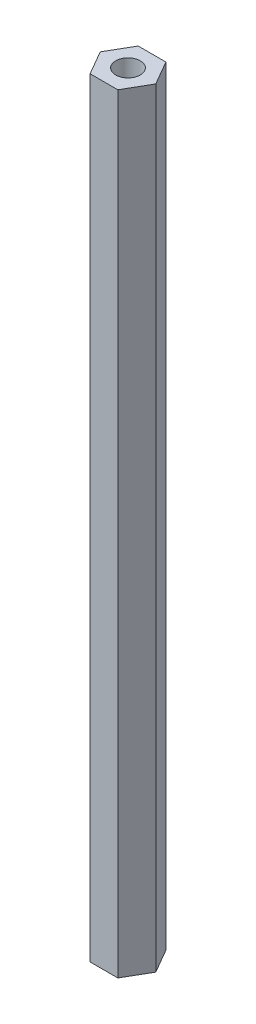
ISO-10303-21;
HEADER;
FILE_DESCRIPTION(('STEP AP214'),'2;1');
FILE_NAME('part.step','',(''),(''),'','','');
FILE_SCHEMA(('AUTOMOTIVE_DESIGN { 1 0 10303 214 1 1 1 1 }'));
ENDSEC;
DATA;
#1=APPLICATION_CONTEXT('core data for automotive mechanical design processes');
#2=APPLICATION_PROTOCOL_DEFINITION('international standard','automotive_design',2000,#1);
#3=PRODUCT_CONTEXT('',#1,'mechanical');
#4=PRODUCT('Part','Part','',(#3));
#5=PRODUCT_RELATED_PRODUCT_CATEGORY('part','',(#4));
#6=PRODUCT_DEFINITION_FORMATION('','',#4);
#7=PRODUCT_DEFINITION_CONTEXT('part definition',#1,'design');
#8=PRODUCT_DEFINITION('design','',#6,#7);
#9=PRODUCT_DEFINITION_SHAPE('','',#8);
#10=(LENGTH_UNIT() NAMED_UNIT(*) SI_UNIT(.MILLI.,.METRE.));
#11=(NAMED_UNIT(*) PLANE_ANGLE_UNIT() SI_UNIT($,.RADIAN.));
#12=(NAMED_UNIT(*) SI_UNIT($,.STERADIAN.) SOLID_ANGLE_UNIT());
#13=UNCERTAINTY_MEASURE_WITH_UNIT(LENGTH_MEASURE(1.E-05),#10,'distance_accuracy_value','');
#14=(GEOMETRIC_REPRESENTATION_CONTEXT(3) GLOBAL_UNCERTAINTY_ASSIGNED_CONTEXT((#13)) GLOBAL_UNIT_ASSIGNED_CONTEXT((#10,
#11,#12)) REPRESENTATION_CONTEXT('',''));
#15=CARTESIAN_POINT('',(0.,0.,0.));
#16=DIRECTION('',(0.,0.,1.));
#17=DIRECTION('',(1.,0.,0.));
#18=AXIS2_PLACEMENT_3D('',#15,#16,#17);
#19=CARTESIAN_POINT('',(0.,101.6,0.));
#20=DIRECTION('',(0.,1.,0.));
#21=DIRECTION('',(0.,0.,1.));
#22=AXIS2_PLACEMENT_3D('',#19,#20,#21);
#23=PLANE('',#22);
#24=DIRECTION('',(-0.500000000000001,0.,-0.866025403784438));
#25=VECTOR('',#24,1.);
#26=CARTESIAN_POINT('',(3.66617420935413,101.6,0.));
#27=LINE('',#26,#25);
#28=CARTESIAN_POINT('',(3.66617420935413,101.6,0.));
#29=VERTEX_POINT('',#28);
#30=CARTESIAN_POINT('',(1.83308710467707,101.6,-3.175));
#31=VERTEX_POINT('',#30);
#32=EDGE_CURVE('E128',#29,#31,#27,.T.);
#33=ORIENTED_EDGE('',*,*,#32,.T.);
#34=DIRECTION('',(-1.,0.,0.));
#35=VECTOR('',#34,1.);
#36=CARTESIAN_POINT('',(1.83308710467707,101.6,-3.175));
#37=LINE('',#36,#35);
#38=CARTESIAN_POINT('',(-1.83308710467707,101.6,-3.175));
#39=VERTEX_POINT('',#38);
#40=EDGE_CURVE('E86',#31,#39,#37,.T.);
#41=ORIENTED_EDGE('',*,*,#40,.T.);
#42=DIRECTION('',(-0.500000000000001,0.,0.866025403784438));
#43=VECTOR('',#42,1.);
#44=CARTESIAN_POINT('',(-1.83308710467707,101.6,-3.175));
#45=LINE('',#44,#43);
#46=CARTESIAN_POINT('',(-3.66617420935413,101.6,0.));
#47=VERTEX_POINT('',#46);
#48=EDGE_CURVE('E99',#39,#47,#45,.T.);
#49=ORIENTED_EDGE('',*,*,#48,.T.);
#50=DIRECTION('',(0.5,0.,0.866025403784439));
#51=VECTOR('',#50,1.);
#52=CARTESIAN_POINT('',(-3.66617420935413,101.6,0.));
#53=LINE('',#52,#51);
#54=CARTESIAN_POINT('',(-1.83308710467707,101.6,3.175));
#55=VERTEX_POINT('',#54);
#56=EDGE_CURVE('E93',#47,#55,#53,.T.);
#57=ORIENTED_EDGE('',*,*,#56,.T.);
#58=DIRECTION('',(1.,0.,0.));
#59=VECTOR('',#58,1.);
#60=CARTESIAN_POINT('',(-1.83308710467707,101.6,3.175));
#61=LINE('',#60,#59);
#62=CARTESIAN_POINT('',(1.83308710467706,101.6,3.175));
#63=VERTEX_POINT('',#62);
#64=EDGE_CURVE('E97',#55,#63,#61,.T.);
#65=ORIENTED_EDGE('',*,*,#64,.T.);
#66=DIRECTION('',(0.500000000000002,0.,-0.866025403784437));
#67=VECTOR('',#66,1.);
#68=CARTESIAN_POINT('',(1.83308710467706,101.6,3.175));
#69=LINE('',#68,#67);
#70=EDGE_CURVE('E49',#63,#29,#69,.T.);
#71=ORIENTED_EDGE('',*,*,#70,.T.);
#72=EDGE_LOOP('',(#33,#41,#49,#57,#65,#71));
#73=FACE_BOUND('',#72,.T.);
#74=CARTESIAN_POINT('',(0.,101.6,0.));
#75=DIRECTION('',(0.,1.,0.));
#76=DIRECTION('',(0.,0.,1.));
#77=AXIS2_PLACEMENT_3D('',#74,#75,#76);
#78=CIRCLE('',#77,1.6256);
#79=CARTESIAN_POINT('',(0.,101.6,1.6256));
#80=VERTEX_POINT('',#79);
#81=EDGE_CURVE('E121',#80,#80,#78,.T.);
#82=ORIENTED_EDGE('',*,*,#81,.F.);
#83=EDGE_LOOP('',(#82));
#84=FACE_BOUND('',#83,.T.);
#85=ADVANCED_FACE('F32',(#73,#84),#23,.T.);
#86=CARTESIAN_POINT('',(0.,0.,0.));
#87=DIRECTION('',(0.,1.,0.));
#88=DIRECTION('',(0.,0.,1.));
#89=AXIS2_PLACEMENT_3D('',#86,#87,#88);
#90=PLANE('',#89);
#91=DIRECTION('',(-0.500000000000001,0.,-0.866025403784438));
#92=VECTOR('',#91,1.);
#93=CARTESIAN_POINT('',(3.66617420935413,0.,0.));
#94=LINE('',#93,#92);
#95=CARTESIAN_POINT('',(3.66617420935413,0.,0.));
#96=VERTEX_POINT('',#95);
#97=CARTESIAN_POINT('',(1.83308710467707,0.,-3.175));
#98=VERTEX_POINT('',#97);
#99=EDGE_CURVE('E117',#96,#98,#94,.T.);
#100=ORIENTED_EDGE('',*,*,#99,.F.);
#101=DIRECTION('',(0.500000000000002,0.,-0.866025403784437));
#102=VECTOR('',#101,1.);
#103=CARTESIAN_POINT('',(1.83308710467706,0.,3.175));
#104=LINE('',#103,#102);
#105=CARTESIAN_POINT('',(1.83308710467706,0.,3.175));
#106=VERTEX_POINT('',#105);
#107=EDGE_CURVE('E78',#106,#96,#104,.T.);
#108=ORIENTED_EDGE('',*,*,#107,.F.);
#109=DIRECTION('',(1.,0.,0.));
#110=VECTOR('',#109,1.);
#111=CARTESIAN_POINT('',(-1.83308710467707,0.,3.175));
#112=LINE('',#111,#110);
#113=CARTESIAN_POINT('',(-1.83308710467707,0.,3.175));
#114=VERTEX_POINT('',#113);
#115=EDGE_CURVE('E72',#114,#106,#112,.T.);
#116=ORIENTED_EDGE('',*,*,#115,.F.);
#117=DIRECTION('',(0.5,0.,0.866025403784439));
#118=VECTOR('',#117,1.);
#119=CARTESIAN_POINT('',(-3.66617420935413,0.,0.));
#120=LINE('',#119,#118);
#121=CARTESIAN_POINT('',(-3.66617420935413,0.,0.));
#122=VERTEX_POINT('',#121);
#123=EDGE_CURVE('E107',#122,#114,#120,.T.);
#124=ORIENTED_EDGE('',*,*,#123,.F.);
#125=DIRECTION('',(-0.500000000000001,0.,0.866025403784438));
#126=VECTOR('',#125,1.);
#127=CARTESIAN_POINT('',(-1.83308710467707,0.,-3.175));
#128=LINE('',#127,#126);
#129=CARTESIAN_POINT('',(-1.83308710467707,0.,-3.175));
#130=VERTEX_POINT('',#129);
#131=EDGE_CURVE('E123',#130,#122,#128,.T.);
#132=ORIENTED_EDGE('',*,*,#131,.F.);
#133=DIRECTION('',(-1.,0.,0.));
#134=VECTOR('',#133,1.);
#135=CARTESIAN_POINT('',(1.83308710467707,0.,-3.175));
#136=LINE('',#135,#134);
#137=EDGE_CURVE('E120',#98,#130,#136,.T.);
#138=ORIENTED_EDGE('',*,*,#137,.F.);
#139=EDGE_LOOP('',(#100,#108,#116,#124,#132,#138));
#140=FACE_BOUND('',#139,.T.);
#141=CARTESIAN_POINT('',(0.,0.,0.));
#142=DIRECTION('',(0.,1.,0.));
#143=DIRECTION('',(0.,0.,1.));
#144=AXIS2_PLACEMENT_3D('',#141,#142,#143);
#145=CIRCLE('',#144,1.6256);
#146=CARTESIAN_POINT('',(0.,0.,1.6256));
#147=VERTEX_POINT('',#146);
#148=EDGE_CURVE('E221',#147,#147,#145,.T.);
#149=ORIENTED_EDGE('',*,*,#148,.T.);
#150=EDGE_LOOP('',(#149));
#151=FACE_BOUND('',#150,.T.);
#152=ADVANCED_FACE('F137',(#140,#151),#90,.F.);
#153=CARTESIAN_POINT('',(3.66617420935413,101.6,0.));
#154=DIRECTION('',(-0.866025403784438,0.,0.500000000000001));
#155=DIRECTION('',(0.500000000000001,0.,0.866025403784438));
#156=AXIS2_PLACEMENT_3D('',#153,#154,#155);
#157=PLANE('',#156);
#158=ORIENTED_EDGE('',*,*,#99,.T.);
#159=DIRECTION('',(0.,-1.,0.));
#160=VECTOR('',#159,1.);
#161=CARTESIAN_POINT('',(1.83308710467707,101.6,-3.175));
#162=LINE('',#161,#160);
#163=EDGE_CURVE('E11',#31,#98,#162,.T.);
#164=ORIENTED_EDGE('',*,*,#163,.F.);
#165=ORIENTED_EDGE('',*,*,#32,.F.);
#166=DIRECTION('',(0.,-1.,0.));
#167=VECTOR('',#166,1.);
#168=CARTESIAN_POINT('',(3.66617420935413,101.6,0.));
#169=LINE('',#168,#167);
#170=EDGE_CURVE('E113',#29,#96,#169,.T.);
#171=ORIENTED_EDGE('',*,*,#170,.T.);
#172=EDGE_LOOP('',(#158,#164,#165,#171));
#173=FACE_BOUND('',#172,.T.);
#174=ADVANCED_FACE('F34',(#173),#157,.F.);
#175=CARTESIAN_POINT('',(1.83308710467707,101.6,-3.175));
#176=DIRECTION('',(0.,0.,1.));
#177=DIRECTION('',(1.,0.,0.));
#178=AXIS2_PLACEMENT_3D('',#175,#176,#177);
#179=PLANE('',#178);
#180=ORIENTED_EDGE('',*,*,#137,.T.);
#181=DIRECTION('',(0.,-1.,0.));
#182=VECTOR('',#181,1.);
#183=CARTESIAN_POINT('',(-1.83308710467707,101.6,-3.175));
#184=LINE('',#183,#182);
#185=EDGE_CURVE('E41',#39,#130,#184,.T.);
#186=ORIENTED_EDGE('',*,*,#185,.F.);
#187=ORIENTED_EDGE('',*,*,#40,.F.);
#188=ORIENTED_EDGE('',*,*,#163,.T.);
#189=EDGE_LOOP('',(#180,#186,#187,#188));
#190=FACE_BOUND('',#189,.T.);
#191=ADVANCED_FACE('F162',(#190),#179,.F.);
#192=CARTESIAN_POINT('',(-1.83308710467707,101.6,-3.175));
#193=DIRECTION('',(0.866025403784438,0.,0.500000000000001));
#194=DIRECTION('',(0.500000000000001,0.,-0.866025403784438));
#195=AXIS2_PLACEMENT_3D('',#192,#193,#194);
#196=PLANE('',#195);
#197=ORIENTED_EDGE('',*,*,#131,.T.);
#198=DIRECTION('',(0.,-1.,0.));
#199=VECTOR('',#198,1.);
#200=CARTESIAN_POINT('',(-3.66617420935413,101.6,0.));
#201=LINE('',#200,#199);
#202=EDGE_CURVE('E108',#47,#122,#201,.T.);
#203=ORIENTED_EDGE('',*,*,#202,.F.);
#204=ORIENTED_EDGE('',*,*,#48,.F.);
#205=ORIENTED_EDGE('',*,*,#185,.T.);
#206=EDGE_LOOP('',(#197,#203,#204,#205));
#207=FACE_BOUND('',#206,.T.);
#208=ADVANCED_FACE('F134',(#207),#196,.F.);
#209=CARTESIAN_POINT('',(-3.66617420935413,101.6,0.));
#210=DIRECTION('',(0.866025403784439,0.,-0.5));
#211=DIRECTION('',(-0.5,0.,-0.866025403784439));
#212=AXIS2_PLACEMENT_3D('',#209,#210,#211);
#213=PLANE('',#212);
#214=ORIENTED_EDGE('',*,*,#123,.T.);
#215=DIRECTION('',(0.,-1.,0.));
#216=VECTOR('',#215,1.);
#217=CARTESIAN_POINT('',(-1.83308710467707,101.6,3.175));
#218=LINE('',#217,#216);
#219=EDGE_CURVE('E104',#55,#114,#218,.T.);
#220=ORIENTED_EDGE('',*,*,#219,.F.);
#221=ORIENTED_EDGE('',*,*,#56,.F.);
#222=ORIENTED_EDGE('',*,*,#202,.T.);
#223=EDGE_LOOP('',(#214,#220,#221,#222));
#224=FACE_BOUND('',#223,.T.);
#225=ADVANCED_FACE('F105',(#224),#213,.F.);
#226=CARTESIAN_POINT('',(-1.83308710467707,101.6,3.175));
#227=DIRECTION('',(0.,0.,-1.));
#228=DIRECTION('',(-1.,0.,0.));
#229=AXIS2_PLACEMENT_3D('',#226,#227,#228);
#230=PLANE('',#229);
#231=ORIENTED_EDGE('',*,*,#115,.T.);
#232=DIRECTION('',(0.,-1.,0.));
#233=VECTOR('',#232,1.);
#234=CARTESIAN_POINT('',(1.83308710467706,101.6,3.175));
#235=LINE('',#234,#233);
#236=EDGE_CURVE('E109',#63,#106,#235,.T.);
#237=ORIENTED_EDGE('',*,*,#236,.F.);
#238=ORIENTED_EDGE('',*,*,#64,.F.);
#239=ORIENTED_EDGE('',*,*,#219,.T.);
#240=EDGE_LOOP('',(#231,#237,#238,#239));
#241=FACE_BOUND('',#240,.T.);
#242=ADVANCED_FACE('F111',(#241),#230,.F.);
#243=CARTESIAN_POINT('',(1.83308710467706,101.6,3.175));
#244=DIRECTION('',(-0.866025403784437,0.,-0.500000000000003));
#245=DIRECTION('',(-0.500000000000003,0.,0.866025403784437));
#246=AXIS2_PLACEMENT_3D('',#243,#244,#245);
#247=PLANE('',#246);
#248=ORIENTED_EDGE('',*,*,#107,.T.);
#249=ORIENTED_EDGE('',*,*,#170,.F.);
#250=ORIENTED_EDGE('',*,*,#70,.F.);
#251=ORIENTED_EDGE('',*,*,#236,.T.);
#252=EDGE_LOOP('',(#248,#249,#250,#251));
#253=FACE_BOUND('',#252,.T.);
#254=ADVANCED_FACE('F142',(#253),#247,.F.);
#255=CARTESIAN_POINT('',(0.,101.6,0.));
#256=DIRECTION('',(0.,-1.,0.));
#257=DIRECTION('',(0.,0.,-1.));
#258=AXIS2_PLACEMENT_3D('',#255,#256,#257);
#259=CYLINDRICAL_SURFACE('',#258,1.6256);
#260=ORIENTED_EDGE('',*,*,#81,.T.);
#261=EDGE_LOOP('',(#260));
#262=FACE_BOUND('',#261,.T.);
#263=ORIENTED_EDGE('',*,*,#148,.F.);
#264=EDGE_LOOP('',(#263));
#265=FACE_BOUND('',#264,.T.);
#266=ADVANCED_FACE('F144',(#262,#265),#259,.F.);
#267=CLOSED_SHELL('',(#85,#152,#174,#191,#208,#225,#242,#254,#266));
#268=MANIFOLD_SOLID_BREP('B2',#267);
#269=ADVANCED_BREP_SHAPE_REPRESENTATION('',(#18,#268),#14);
#270=SHAPE_DEFINITION_REPRESENTATION(#9,#269);
ENDSEC;
END-ISO-10303-21;
